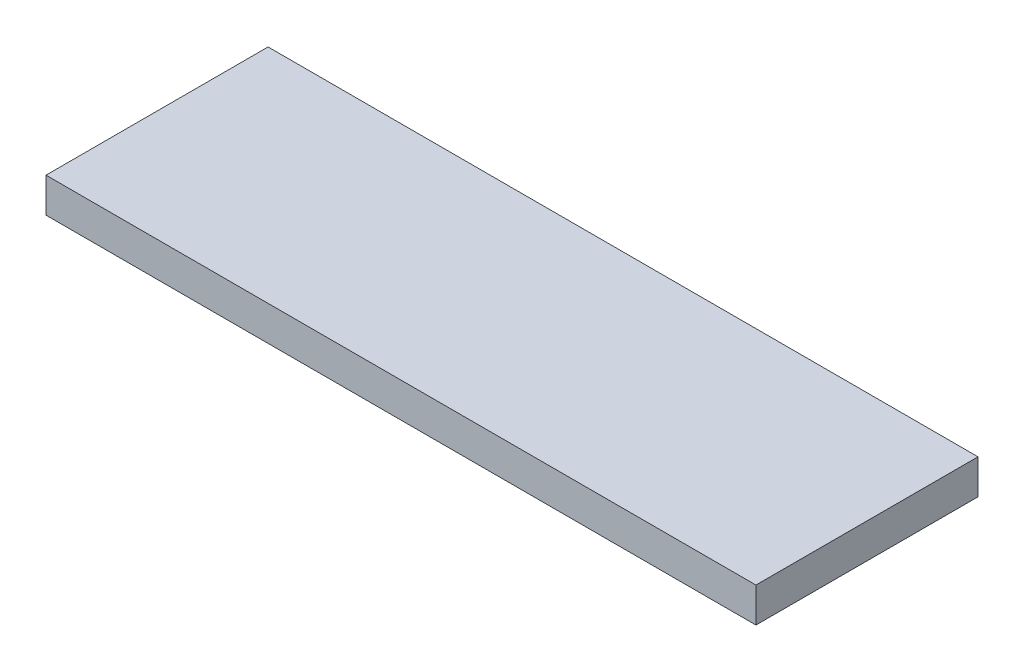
from build123d import *

# Parameters (mm, degrees)
SKETCH3_W           = 390
SKETCH3_H           = 122
BOSS_EXTRUDE1_DEPTH = 19.05


with BuildPart() as part:
    # Sketch3 → Boss-Extrude1 (new body)
    with BuildSketch(Plane(origin=(0, 0, 0), x_dir=(-1, 0, 0), z_dir=(0, 1, 0))):
        Rectangle(SKETCH3_W, SKETCH3_H)
    extrude(amount=BOSS_EXTRUDE1_DEPTH)


solid = part.part
